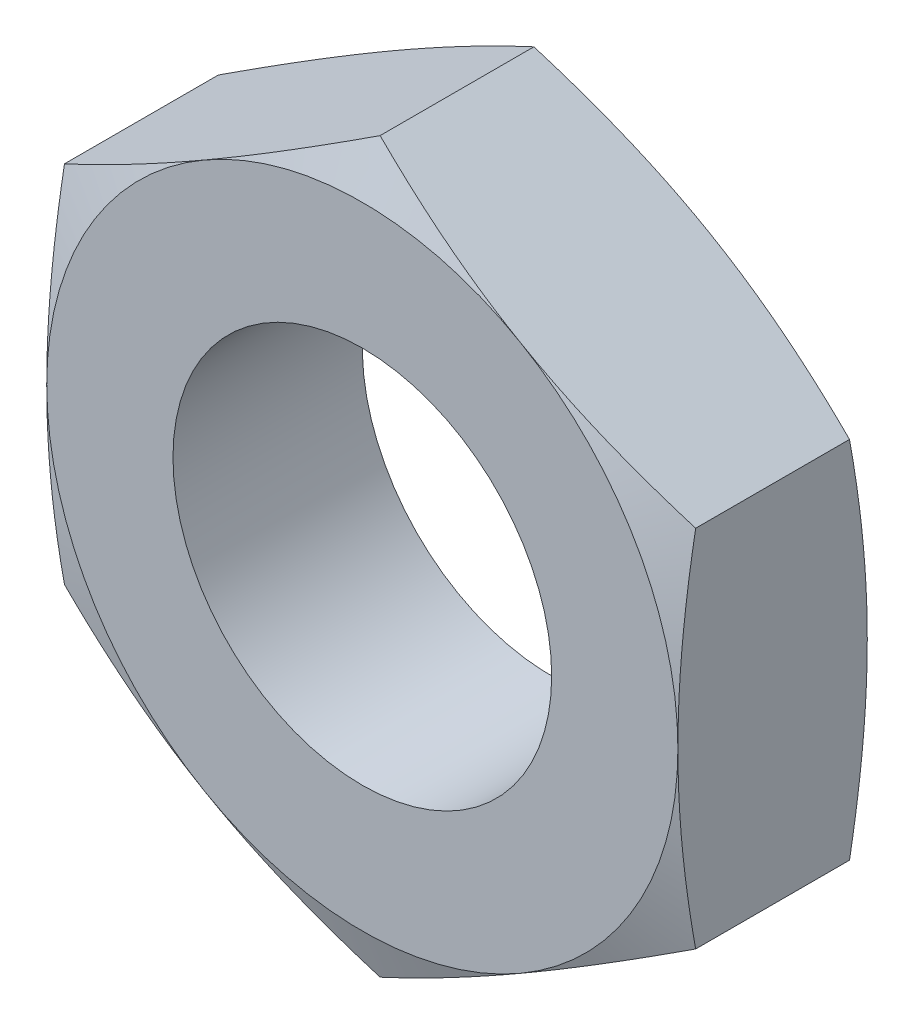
ISO-10303-21;
HEADER;
FILE_DESCRIPTION(('STEP AP214'),'2;1');
FILE_NAME('part.step','',(''),(''),'','','');
FILE_SCHEMA(('AUTOMOTIVE_DESIGN { 1 0 10303 214 1 1 1 1 }'));
ENDSEC;
DATA;
#1=APPLICATION_CONTEXT('core data for automotive mechanical design processes');
#2=APPLICATION_PROTOCOL_DEFINITION('international standard','automotive_design',2000,#1);
#3=PRODUCT_CONTEXT('',#1,'mechanical');
#4=PRODUCT('Part','Part','',(#3));
#5=PRODUCT_RELATED_PRODUCT_CATEGORY('part','',(#4));
#6=PRODUCT_DEFINITION_FORMATION('','',#4);
#7=PRODUCT_DEFINITION_CONTEXT('part definition',#1,'design');
#8=PRODUCT_DEFINITION('design','',#6,#7);
#9=PRODUCT_DEFINITION_SHAPE('','',#8);
#10=(LENGTH_UNIT() NAMED_UNIT(*) SI_UNIT(.MILLI.,.METRE.));
#11=(NAMED_UNIT(*) PLANE_ANGLE_UNIT() SI_UNIT($,.RADIAN.));
#12=(NAMED_UNIT(*) SI_UNIT($,.STERADIAN.) SOLID_ANGLE_UNIT());
#13=UNCERTAINTY_MEASURE_WITH_UNIT(LENGTH_MEASURE(1.E-05),#10,'distance_accuracy_value','');
#14=(GEOMETRIC_REPRESENTATION_CONTEXT(3) GLOBAL_UNCERTAINTY_ASSIGNED_CONTEXT((#13)) GLOBAL_UNIT_ASSIGNED_CONTEXT((#10,
#11,#12)) REPRESENTATION_CONTEXT('',''));
#15=CARTESIAN_POINT('',(0.,0.,0.));
#16=DIRECTION('',(0.,0.,1.));
#17=DIRECTION('',(1.,0.,0.));
#18=AXIS2_PLACEMENT_3D('',#15,#16,#17);
#19=CARTESIAN_POINT('',(5.,5.06000330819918,3.00000000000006));
#20=DIRECTION('',(0.,0.,1.));
#21=DIRECTION('',(-1.,0.,0.));
#22=AXIS2_PLACEMENT_3D('',#19,#20,#21);
#23=PLANE('',#22);
#24=CARTESIAN_POINT('',(0.,0.,3.));
#25=DIRECTION('',(0.,0.,1.));
#26=DIRECTION('',(0.,-1.,0.));
#27=AXIS2_PLACEMENT_3D('',#24,#25,#26);
#28=CIRCLE('',#27,3.);
#29=CARTESIAN_POINT('',(0.,-3.00000000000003,2.99999999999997));
#30=VERTEX_POINT('',#29);
#31=EDGE_CURVE('E109',#30,#30,#28,.T.);
#32=ORIENTED_EDGE('',*,*,#31,.F.);
#33=EDGE_LOOP('',(#32));
#34=FACE_BOUND('',#33,.T.);
#35=CARTESIAN_POINT('',(0.,0.,3.));
#36=DIRECTION('',(0.,0.,-1.));
#37=DIRECTION('',(0.,1.,0.));
#38=AXIS2_PLACEMENT_3D('',#35,#36,#37);
#39=CIRCLE('',#38,5.);
#40=CARTESIAN_POINT('',(-2.5,-4.33012701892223,2.99999999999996));
#41=VERTEX_POINT('',#40);
#42=CARTESIAN_POINT('',(-5.,0.,3.));
#43=VERTEX_POINT('',#42);
#44=EDGE_CURVE('E104',#41,#43,#39,.T.);
#45=ORIENTED_EDGE('',*,*,#44,.F.);
#46=CARTESIAN_POINT('',(0.,0.,3.));
#47=DIRECTION('',(0.,0.,-1.));
#48=DIRECTION('',(0.,1.,0.));
#49=AXIS2_PLACEMENT_3D('',#46,#47,#48);
#50=CIRCLE('',#49,5.);
#51=CARTESIAN_POINT('',(2.5,-4.33012701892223,2.99999999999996));
#52=VERTEX_POINT('',#51);
#53=EDGE_CURVE('E17',#52,#41,#50,.T.);
#54=ORIENTED_EDGE('',*,*,#53,.F.);
#55=CARTESIAN_POINT('',(0.,0.,3.));
#56=DIRECTION('',(0.,0.,-1.));
#57=DIRECTION('',(0.,1.,0.));
#58=AXIS2_PLACEMENT_3D('',#55,#56,#57);
#59=CIRCLE('',#58,5.);
#60=CARTESIAN_POINT('',(5.,0.,3.));
#61=VERTEX_POINT('',#60);
#62=EDGE_CURVE('E101',#61,#52,#59,.T.);
#63=ORIENTED_EDGE('',*,*,#62,.F.);
#64=CARTESIAN_POINT('',(0.,0.,3.));
#65=DIRECTION('',(0.,0.,-1.));
#66=DIRECTION('',(0.,1.,0.));
#67=AXIS2_PLACEMENT_3D('',#64,#65,#66);
#68=CIRCLE('',#67,5.);
#69=CARTESIAN_POINT('',(2.5,4.33012701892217,3.00000000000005));
#70=VERTEX_POINT('',#69);
#71=EDGE_CURVE('E133',#70,#61,#68,.T.);
#72=ORIENTED_EDGE('',*,*,#71,.F.);
#73=CARTESIAN_POINT('',(0.,0.,3.));
#74=DIRECTION('',(0.,0.,-1.));
#75=DIRECTION('',(0.,1.,0.));
#76=AXIS2_PLACEMENT_3D('',#73,#74,#75);
#77=CIRCLE('',#76,5.);
#78=CARTESIAN_POINT('',(-2.5,4.33012701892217,3.00000000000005));
#79=VERTEX_POINT('',#78);
#80=EDGE_CURVE('E119',#79,#70,#77,.T.);
#81=ORIENTED_EDGE('',*,*,#80,.F.);
#82=CARTESIAN_POINT('',(0.,0.,3.));
#83=DIRECTION('',(0.,0.,-1.));
#84=DIRECTION('',(0.,1.,0.));
#85=AXIS2_PLACEMENT_3D('',#82,#83,#84);
#86=CIRCLE('',#85,5.);
#87=EDGE_CURVE('E120',#43,#79,#86,.T.);
#88=ORIENTED_EDGE('',*,*,#87,.F.);
#89=EDGE_LOOP('',(#45,#54,#63,#72,#81,#88));
#90=FACE_BOUND('',#89,.T.);
#91=ADVANCED_FACE('F14',(#34,#90),#23,.T.);
#92=CARTESIAN_POINT('',(0.,0.,3.));
#93=DIRECTION('',(0.,0.,-1.));
#94=DIRECTION('',(0.,1.,0.));
#95=AXIS2_PLACEMENT_3D('',#92,#93,#94);
#96=CONICAL_SURFACE('',#95,5.,1.22173047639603);
#97=ORIENTED_EDGE('',*,*,#53,.T.);
#98=CARTESIAN_POINT('',(0.,-5.77350269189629,2.71846804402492));
#99=CARTESIAN_POINT('',(-0.206342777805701,-5.65437063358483,2.76184718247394));
#100=CARTESIAN_POINT('',(-0.413378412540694,-5.53483855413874,2.80131801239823));
#101=CARTESIAN_POINT('',(-0.828198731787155,-5.29534193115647,2.87070272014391));
#102=CARTESIAN_POINT('',(-1.03598096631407,-5.17537880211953,2.90063628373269));
#103=CARTESIAN_POINT('',(-1.34843659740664,-4.99498245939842,2.93721548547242));
#104=CARTESIAN_POINT('',(-1.4527458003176,-4.93475951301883,2.94802340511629));
#105=CARTESIAN_POINT('',(-1.66156247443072,-4.81419915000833,2.96669455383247));
#106=CARTESIAN_POINT('',(-1.76606994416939,-4.75386173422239,2.97455780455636));
#107=CARTESIAN_POINT('',(-1.97544117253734,-4.63298119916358,2.98721270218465));
#108=CARTESIAN_POINT('',(-2.08030522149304,-4.5724379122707,2.99199798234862));
#109=CARTESIAN_POINT('',(-2.29011229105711,-4.45130574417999,2.99839680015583));
#110=CARTESIAN_POINT('',(-2.39505531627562,-4.39071686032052,3.00001013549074));
#111=CARTESIAN_POINT('',(-2.5,-4.33012701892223,2.99999999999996));
#112=B_SPLINE_CURVE_WITH_KNOTS('',3,(#98,#99,#100,#101,#102,#103,#104,#105,#106,#107,#108,#109,
#110,#111),.UNSPECIFIED.,.F.,.F.,(4,2,2,2,2,2,4),(0.,0.726649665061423,1.45178959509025,
1.81454632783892,2.17730039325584,2.54080241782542,2.90432762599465),.UNSPECIFIED.);
#113=CARTESIAN_POINT('',(0.,-5.77350269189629,2.71846804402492));
#114=VERTEX_POINT('',#113);
#115=EDGE_CURVE('E125',#114,#41,#112,.T.);
#116=ORIENTED_EDGE('',*,*,#115,.F.);
#117=CARTESIAN_POINT('',(2.5,-4.33012701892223,2.99999999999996));
#118=CARTESIAN_POINT('',(2.39505531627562,-4.39071686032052,3.00001013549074));
#119=CARTESIAN_POINT('',(2.29011229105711,-4.45130574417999,2.99839680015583));
#120=CARTESIAN_POINT('',(2.08030522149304,-4.5724379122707,2.99199798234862));
#121=CARTESIAN_POINT('',(1.97544117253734,-4.63298119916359,2.98721270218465));
#122=CARTESIAN_POINT('',(1.76606994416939,-4.75386173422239,2.97455780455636));
#123=CARTESIAN_POINT('',(1.66156247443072,-4.81419915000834,2.96669455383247));
#124=CARTESIAN_POINT('',(1.4527458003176,-4.93475951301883,2.94802340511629));
#125=CARTESIAN_POINT('',(1.34843659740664,-4.99498245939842,2.93721548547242));
#126=CARTESIAN_POINT('',(1.03598096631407,-5.17537880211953,2.90063628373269));
#127=CARTESIAN_POINT('',(0.828198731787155,-5.29534193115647,2.87070272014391));
#128=CARTESIAN_POINT('',(0.413378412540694,-5.53483855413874,2.80131801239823));
#129=CARTESIAN_POINT('',(0.206342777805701,-5.65437063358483,2.76184718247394));
#130=CARTESIAN_POINT('',(0.,-5.77350269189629,2.71846804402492));
#131=B_SPLINE_CURVE_WITH_KNOTS('',3,(#117,#118,#119,#120,#121,#122,#123,#124,#125,#126,#127,
#128,#129,#130),.UNSPECIFIED.,.F.,.F.,(4,2,2,2,2,2,4),(0.,0.363525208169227,0.727027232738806,
1.08978129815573,1.4525380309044,2.17767796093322,2.90432762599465),.UNSPECIFIED.);
#132=EDGE_CURVE('E122',#52,#114,#131,.T.);
#133=ORIENTED_EDGE('',*,*,#132,.F.);
#134=EDGE_LOOP('',(#97,#116,#133));
#135=FACE_BOUND('',#134,.T.);
#136=ADVANCED_FACE('F123',(#135),#96,.T.);
#137=CARTESIAN_POINT('',(0.,0.,3.));
#138=DIRECTION('',(0.,0.,-1.));
#139=DIRECTION('',(0.,1.,0.));
#140=AXIS2_PLACEMENT_3D('',#137,#138,#139);
#141=CONICAL_SURFACE('',#140,5.,1.22173047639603);
#142=ORIENTED_EDGE('',*,*,#44,.T.);
#143=CARTESIAN_POINT('',(-5.,-2.88675134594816,2.71846804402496));
#144=CARTESIAN_POINT('',(-5.,-2.64848722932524,2.76184718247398));
#145=CARTESIAN_POINT('',(-5.,-2.40942307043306,2.80131801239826));
#146=CARTESIAN_POINT('',(-5.,-1.93042982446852,2.87070272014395));
#147=CARTESIAN_POINT('',(-5.,-1.69050356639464,2.90063628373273));
#148=CARTESIAN_POINT('',(-5.,-1.32971088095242,2.93721548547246));
#149=CARTESIAN_POINT('',(-5.,-1.20926498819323,2.94802340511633));
#150=CARTESIAN_POINT('',(-5.,-0.968144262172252,2.96669455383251));
#151=CARTESIAN_POINT('',(-5.,-0.847469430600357,2.9745578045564));
#152=CARTESIAN_POINT('',(-5.,-0.605708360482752,2.98721270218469));
#153=CARTESIAN_POINT('',(-5.,-0.484621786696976,2.99199798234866));
#154=CARTESIAN_POINT('',(-5.,-0.24235745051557,2.99839680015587));
#155=CARTESIAN_POINT('',(-5.,-0.121179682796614,3.00001013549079));
#156=CARTESIAN_POINT('',(-5.,0.,3.));
#157=B_SPLINE_CURVE_WITH_KNOTS('',3,(#143,#144,#145,#146,#147,#148,#149,#150,#151,#152,#153,
#154,#155,#156),.UNSPECIFIED.,.F.,.F.,(4,2,2,2,2,2,4),(0.,0.726649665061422,1.45178959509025,
1.81454632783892,2.17730039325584,2.54080241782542,2.90432762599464),.UNSPECIFIED.);
#158=CARTESIAN_POINT('',(-5.,-2.88675134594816,2.71846804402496));
#159=VERTEX_POINT('',#158);
#160=EDGE_CURVE('E288',#159,#43,#157,.T.);
#161=ORIENTED_EDGE('',*,*,#160,.F.);
#162=CARTESIAN_POINT('',(-2.5,-4.33012701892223,2.99999999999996));
#163=CARTESIAN_POINT('',(-2.60494468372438,-4.26953717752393,3.00001013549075));
#164=CARTESIAN_POINT('',(-2.70988770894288,-4.20894829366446,2.99839680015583));
#165=CARTESIAN_POINT('',(-2.91969477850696,-4.08781612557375,2.99199798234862));
#166=CARTESIAN_POINT('',(-3.02455882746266,-4.02727283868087,2.98721270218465));
#167=CARTESIAN_POINT('',(-3.23393005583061,-3.90639230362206,2.97455780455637));
#168=CARTESIAN_POINT('',(-3.33843752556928,-3.84605488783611,2.96669455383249));
#169=CARTESIAN_POINT('',(-3.5472541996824,-3.72549452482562,2.94802340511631));
#170=CARTESIAN_POINT('',(-3.65156340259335,-3.66527157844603,2.93721548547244));
#171=CARTESIAN_POINT('',(-3.96401903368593,-3.48487523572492,2.90063628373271));
#172=CARTESIAN_POINT('',(-4.17180126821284,-3.36491210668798,2.87070272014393));
#173=CARTESIAN_POINT('',(-4.5866215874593,-3.12541548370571,2.80131801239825));
#174=CARTESIAN_POINT('',(-4.7936572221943,-3.00588340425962,2.76184718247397));
#175=CARTESIAN_POINT('',(-5.,-2.88675134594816,2.71846804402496));
#176=B_SPLINE_CURVE_WITH_KNOTS('',3,(#162,#163,#164,#165,#166,#167,#168,#169,#170,#171,#172,
#173,#174,#175),.UNSPECIFIED.,.F.,.F.,(4,2,2,2,2,2,4),(0.,0.363525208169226,0.727027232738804,
1.08978129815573,1.45253803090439,2.17767796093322,2.90432762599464),.UNSPECIFIED.);
#177=EDGE_CURVE('E269',#41,#159,#176,.T.);
#178=ORIENTED_EDGE('',*,*,#177,.F.);
#179=EDGE_LOOP('',(#142,#161,#178));
#180=FACE_BOUND('',#179,.T.);
#181=ADVANCED_FACE('F282',(#180),#141,.T.);
#182=CARTESIAN_POINT('',(0.,0.,3.));
#183=DIRECTION('',(0.,0.,-1.));
#184=DIRECTION('',(0.,1.,0.));
#185=AXIS2_PLACEMENT_3D('',#182,#183,#184);
#186=CONICAL_SURFACE('',#185,5.,1.22173047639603);
#187=CARTESIAN_POINT('',(-5.,0.,3.));
#188=CARTESIAN_POINT('',(-5.,0.121179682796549,3.00001013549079));
#189=CARTESIAN_POINT('',(-5.,0.242357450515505,2.99839680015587));
#190=CARTESIAN_POINT('',(-5.,0.484621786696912,2.99199798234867));
#191=CARTESIAN_POINT('',(-5.,0.605708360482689,2.9872127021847));
#192=CARTESIAN_POINT('',(-5.,0.847469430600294,2.97455780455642));
#193=CARTESIAN_POINT('',(-5.,0.968144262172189,2.96669455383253));
#194=CARTESIAN_POINT('',(-5.,1.20926498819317,2.94802340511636));
#195=CARTESIAN_POINT('',(-5.,1.32971088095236,2.93721548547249));
#196=CARTESIAN_POINT('',(-5.,1.69050356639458,2.90063628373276));
#197=CARTESIAN_POINT('',(-5.,1.93042982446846,2.87070272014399));
#198=CARTESIAN_POINT('',(-5.,2.409423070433,2.80131801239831));
#199=CARTESIAN_POINT('',(-5.,2.64848722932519,2.76184718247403));
#200=CARTESIAN_POINT('',(-5.,2.8867513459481,2.71846804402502));
#201=B_SPLINE_CURVE_WITH_KNOTS('',3,(#187,#188,#189,#190,#191,#192,#193,#194,#195,#196,#197,
#198,#199,#200),.UNSPECIFIED.,.F.,.F.,(4,2,2,2,2,2,4),(0.,0.363525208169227,0.727027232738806,
1.08978129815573,1.4525380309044,2.17767796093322,2.90432762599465),.UNSPECIFIED.);
#202=CARTESIAN_POINT('',(-5.,2.8867513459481,2.71846804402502));
#203=VERTEX_POINT('',#202);
#204=EDGE_CURVE('E295',#43,#203,#201,.T.);
#205=ORIENTED_EDGE('',*,*,#204,.F.);
#206=ORIENTED_EDGE('',*,*,#87,.T.);
#207=CARTESIAN_POINT('',(-5.,2.8867513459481,2.71846804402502));
#208=CARTESIAN_POINT('',(-4.7936572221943,3.00588340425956,2.76184718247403));
#209=CARTESIAN_POINT('',(-4.58662158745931,3.12541548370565,2.80131801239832));
#210=CARTESIAN_POINT('',(-4.17180126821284,3.36491210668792,2.870702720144));
#211=CARTESIAN_POINT('',(-3.96401903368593,3.48487523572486,2.90063628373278));
#212=CARTESIAN_POINT('',(-3.65156340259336,3.66527157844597,2.93721548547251));
#213=CARTESIAN_POINT('',(-3.5472541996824,3.72549452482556,2.94802340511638));
#214=CARTESIAN_POINT('',(-3.33843752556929,3.84605488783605,2.96669455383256));
#215=CARTESIAN_POINT('',(-3.23393005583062,3.906392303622,2.97455780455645));
#216=CARTESIAN_POINT('',(-3.02455882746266,4.02727283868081,2.98721270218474));
#217=CARTESIAN_POINT('',(-2.91969477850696,4.08781612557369,2.99199798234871));
#218=CARTESIAN_POINT('',(-2.70988770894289,4.2089482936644,2.99839680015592));
#219=CARTESIAN_POINT('',(-2.60494468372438,4.26953717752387,3.00001013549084));
#220=CARTESIAN_POINT('',(-2.5,4.33012701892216,3.00000000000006));
#221=B_SPLINE_CURVE_WITH_KNOTS('',3,(#207,#208,#209,#210,#211,#212,#213,#214,#215,#216,#217,
#218,#219,#220),.UNSPECIFIED.,.F.,.F.,(4,2,2,2,2,2,4),(0.,0.726649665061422,1.45178959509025,
1.81454632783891,2.17730039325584,2.54080241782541,2.90432762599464),.UNSPECIFIED.);
#222=EDGE_CURVE('E303',#203,#79,#221,.T.);
#223=ORIENTED_EDGE('',*,*,#222,.F.);
#224=EDGE_LOOP('',(#205,#206,#223));
#225=FACE_BOUND('',#224,.T.);
#226=ADVANCED_FACE('F156',(#225),#186,.T.);
#227=CARTESIAN_POINT('',(0.,0.,3.));
#228=DIRECTION('',(0.,0.,-1.));
#229=DIRECTION('',(0.,1.,0.));
#230=AXIS2_PLACEMENT_3D('',#227,#228,#229);
#231=CONICAL_SURFACE('',#230,5.,1.22173047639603);
#232=ORIENTED_EDGE('',*,*,#62,.T.);
#233=CARTESIAN_POINT('',(5.,-2.88675134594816,2.71846804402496));
#234=CARTESIAN_POINT('',(4.7936572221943,-3.00588340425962,2.76184718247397));
#235=CARTESIAN_POINT('',(4.5866215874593,-3.12541548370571,2.80131801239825));
#236=CARTESIAN_POINT('',(4.17180126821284,-3.36491210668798,2.87070272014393));
#237=CARTESIAN_POINT('',(3.96401903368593,-3.48487523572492,2.90063628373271));
#238=CARTESIAN_POINT('',(3.65156340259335,-3.66527157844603,2.93721548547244));
#239=CARTESIAN_POINT('',(3.5472541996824,-3.72549452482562,2.94802340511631));
#240=CARTESIAN_POINT('',(3.33843752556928,-3.84605488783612,2.96669455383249));
#241=CARTESIAN_POINT('',(3.23393005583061,-3.90639230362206,2.97455780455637));
#242=CARTESIAN_POINT('',(3.02455882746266,-4.02727283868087,2.98721270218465));
#243=CARTESIAN_POINT('',(2.91969477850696,-4.08781612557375,2.99199798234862));
#244=CARTESIAN_POINT('',(2.70988770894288,-4.20894829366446,2.99839680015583));
#245=CARTESIAN_POINT('',(2.60494468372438,-4.26953717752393,3.00001013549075));
#246=CARTESIAN_POINT('',(2.5,-4.33012701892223,2.99999999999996));
#247=B_SPLINE_CURVE_WITH_KNOTS('',3,(#233,#234,#235,#236,#237,#238,#239,#240,#241,#242,#243,
#244,#245,#246),.UNSPECIFIED.,.F.,.F.,(4,2,2,2,2,2,4),(0.,0.726649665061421,1.45178959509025,
1.81454632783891,2.17730039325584,2.54080241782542,2.90432762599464),.UNSPECIFIED.);
#248=CARTESIAN_POINT('',(5.,-2.88675134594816,2.71846804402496));
#249=VERTEX_POINT('',#248);
#250=EDGE_CURVE('E114',#249,#52,#247,.T.);
#251=ORIENTED_EDGE('',*,*,#250,.F.);
#252=CARTESIAN_POINT('',(5.,0.,3.));
#253=CARTESIAN_POINT('',(5.,-0.121179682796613,3.00001013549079));
#254=CARTESIAN_POINT('',(5.,-0.242357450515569,2.99839680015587));
#255=CARTESIAN_POINT('',(5.,-0.484621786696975,2.99199798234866));
#256=CARTESIAN_POINT('',(5.,-0.605708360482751,2.98721270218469));
#257=CARTESIAN_POINT('',(5.,-0.847469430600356,2.9745578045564));
#258=CARTESIAN_POINT('',(5.,-0.968144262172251,2.96669455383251));
#259=CARTESIAN_POINT('',(5.,-1.20926498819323,2.94802340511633));
#260=CARTESIAN_POINT('',(5.,-1.32971088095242,2.93721548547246));
#261=CARTESIAN_POINT('',(5.,-1.69050356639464,2.90063628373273));
#262=CARTESIAN_POINT('',(5.,-1.93042982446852,2.87070272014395));
#263=CARTESIAN_POINT('',(5.,-2.40942307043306,2.80131801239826));
#264=CARTESIAN_POINT('',(5.,-2.64848722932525,2.76184718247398));
#265=CARTESIAN_POINT('',(5.,-2.88675134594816,2.71846804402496));
#266=B_SPLINE_CURVE_WITH_KNOTS('',3,(#252,#253,#254,#255,#256,#257,#258,#259,#260,#261,#262,
#263,#264,#265),.UNSPECIFIED.,.F.,.F.,(4,2,2,2,2,2,4),(0.,0.363525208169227,0.727027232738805,
1.08978129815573,1.4525380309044,2.17767796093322,2.90432762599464),.UNSPECIFIED.);
#267=EDGE_CURVE('E117',#61,#249,#266,.T.);
#268=ORIENTED_EDGE('',*,*,#267,.F.);
#269=EDGE_LOOP('',(#232,#251,#268));
#270=FACE_BOUND('',#269,.T.);
#271=ADVANCED_FACE('F112',(#270),#231,.T.);
#272=CARTESIAN_POINT('',(0.,0.,3.));
#273=DIRECTION('',(0.,0.,-1.));
#274=DIRECTION('',(0.,1.,0.));
#275=AXIS2_PLACEMENT_3D('',#272,#273,#274);
#276=CONICAL_SURFACE('',#275,5.,1.22173047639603);
#277=CARTESIAN_POINT('',(-2.5,4.33012701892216,3.00000000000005));
#278=CARTESIAN_POINT('',(-2.39505531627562,4.39071686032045,3.00001013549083));
#279=CARTESIAN_POINT('',(-2.29011229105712,4.45130574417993,2.99839680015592));
#280=CARTESIAN_POINT('',(-2.08030522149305,4.57243791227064,2.99199798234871));
#281=CARTESIAN_POINT('',(-1.97544117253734,4.63298119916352,2.98721270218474));
#282=CARTESIAN_POINT('',(-1.76606994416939,4.75386173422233,2.97455780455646));
#283=CARTESIAN_POINT('',(-1.66156247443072,4.81419915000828,2.96669455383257));
#284=CARTESIAN_POINT('',(-1.4527458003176,4.93475951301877,2.94802340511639));
#285=CARTESIAN_POINT('',(-1.34843659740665,4.99498245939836,2.93721548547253));
#286=CARTESIAN_POINT('',(-1.03598096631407,5.17537880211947,2.9006362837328));
#287=CARTESIAN_POINT('',(-0.828198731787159,5.29534193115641,2.87070272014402));
#288=CARTESIAN_POINT('',(-0.413378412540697,5.53483855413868,2.80131801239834));
#289=CARTESIAN_POINT('',(-0.206342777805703,5.65437063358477,2.76184718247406));
#290=CARTESIAN_POINT('',(0.,5.77350269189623,2.71846804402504));
#291=B_SPLINE_CURVE_WITH_KNOTS('',3,(#277,#278,#279,#280,#281,#282,#283,#284,#285,#286,#287,
#288,#289,#290),.UNSPECIFIED.,.F.,.F.,(4,2,2,2,2,2,4),(0.,0.363525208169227,0.727027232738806,
1.08978129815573,1.4525380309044,2.17767796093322,2.90432762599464),.UNSPECIFIED.);
#292=CARTESIAN_POINT('',(0.,5.77350269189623,2.71846804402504));
#293=VERTEX_POINT('',#292);
#294=EDGE_CURVE('E309',#79,#293,#291,.T.);
#295=ORIENTED_EDGE('',*,*,#294,.F.);
#296=ORIENTED_EDGE('',*,*,#80,.T.);
#297=CARTESIAN_POINT('',(0.,5.77350269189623,2.71846804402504));
#298=CARTESIAN_POINT('',(0.206342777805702,5.65437063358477,2.76184718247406));
#299=CARTESIAN_POINT('',(0.413378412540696,5.53483855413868,2.80131801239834));
#300=CARTESIAN_POINT('',(0.828198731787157,5.29534193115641,2.87070272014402));
#301=CARTESIAN_POINT('',(1.03598096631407,5.17537880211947,2.9006362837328));
#302=CARTESIAN_POINT('',(1.34843659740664,4.99498245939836,2.93721548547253));
#303=CARTESIAN_POINT('',(1.4527458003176,4.93475951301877,2.94802340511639));
#304=CARTESIAN_POINT('',(1.66156247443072,4.81419915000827,2.96669455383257));
#305=CARTESIAN_POINT('',(1.76606994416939,4.75386173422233,2.97455780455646));
#306=CARTESIAN_POINT('',(1.97544117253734,4.63298119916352,2.98721270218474));
#307=CARTESIAN_POINT('',(2.08030522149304,4.57243791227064,2.99199798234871));
#308=CARTESIAN_POINT('',(2.29011229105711,4.45130574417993,2.99839680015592));
#309=CARTESIAN_POINT('',(2.39505531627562,4.39071686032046,3.00001013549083));
#310=CARTESIAN_POINT('',(2.5,4.33012701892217,3.00000000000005));
#311=B_SPLINE_CURVE_WITH_KNOTS('',3,(#297,#298,#299,#300,#301,#302,#303,#304,#305,#306,#307,
#308,#309,#310),.UNSPECIFIED.,.F.,.F.,(4,2,2,2,2,2,4),(0.,0.726649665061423,1.45178959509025,
1.81454632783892,2.17730039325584,2.54080241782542,2.90432762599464),.UNSPECIFIED.);
#312=EDGE_CURVE('E170',#293,#70,#311,.T.);
#313=ORIENTED_EDGE('',*,*,#312,.F.);
#314=EDGE_LOOP('',(#295,#296,#313));
#315=FACE_BOUND('',#314,.T.);
#316=ADVANCED_FACE('F155',(#315),#276,.T.);
#317=CARTESIAN_POINT('',(0.,0.,3.));
#318=DIRECTION('',(0.,0.,-1.));
#319=DIRECTION('',(0.,1.,0.));
#320=AXIS2_PLACEMENT_3D('',#317,#318,#319);
#321=CONICAL_SURFACE('',#320,5.,1.22173047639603);
#322=CARTESIAN_POINT('',(2.5,4.33012701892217,3.00000000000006));
#323=CARTESIAN_POINT('',(2.60494468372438,4.26953717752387,3.00001013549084));
#324=CARTESIAN_POINT('',(2.70988770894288,4.2089482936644,2.99839680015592));
#325=CARTESIAN_POINT('',(2.91969477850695,4.08781612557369,2.99199798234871));
#326=CARTESIAN_POINT('',(3.02455882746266,4.0272728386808,2.98721270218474));
#327=CARTESIAN_POINT('',(3.23393005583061,3.906392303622,2.97455780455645));
#328=CARTESIAN_POINT('',(3.33843752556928,3.84605488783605,2.96669455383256));
#329=CARTESIAN_POINT('',(3.5472541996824,3.72549452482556,2.94802340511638));
#330=CARTESIAN_POINT('',(3.65156340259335,3.66527157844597,2.93721548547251));
#331=CARTESIAN_POINT('',(3.96401903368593,3.48487523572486,2.90063628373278));
#332=CARTESIAN_POINT('',(4.17180126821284,3.36491210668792,2.870702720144));
#333=CARTESIAN_POINT('',(4.5866215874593,3.12541548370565,2.80131801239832));
#334=CARTESIAN_POINT('',(4.7936572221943,3.00588340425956,2.76184718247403));
#335=CARTESIAN_POINT('',(5.,2.8867513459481,2.71846804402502));
#336=B_SPLINE_CURVE_WITH_KNOTS('',3,(#322,#323,#324,#325,#326,#327,#328,#329,#330,#331,#332,
#333,#334,#335),.UNSPECIFIED.,.F.,.F.,(4,2,2,2,2,2,4),(0.,0.363525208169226,0.727027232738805,
1.08978129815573,1.45253803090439,2.17767796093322,2.90432762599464),.UNSPECIFIED.);
#337=CARTESIAN_POINT('',(5.,2.8867513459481,2.71846804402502));
#338=VERTEX_POINT('',#337);
#339=EDGE_CURVE('E324',#70,#338,#336,.T.);
#340=ORIENTED_EDGE('',*,*,#339,.F.);
#341=ORIENTED_EDGE('',*,*,#71,.T.);
#342=CARTESIAN_POINT('',(5.,2.8867513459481,2.71846804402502));
#343=CARTESIAN_POINT('',(5.,2.64848722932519,2.76184718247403));
#344=CARTESIAN_POINT('',(5.,2.409423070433,2.80131801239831));
#345=CARTESIAN_POINT('',(5.,1.93042982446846,2.87070272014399));
#346=CARTESIAN_POINT('',(5.,1.69050356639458,2.90063628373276));
#347=CARTESIAN_POINT('',(5.,1.32971088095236,2.93721548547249));
#348=CARTESIAN_POINT('',(5.,1.20926498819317,2.94802340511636));
#349=CARTESIAN_POINT('',(5.,0.96814426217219,2.96669455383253));
#350=CARTESIAN_POINT('',(5.,0.847469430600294,2.97455780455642));
#351=CARTESIAN_POINT('',(5.,0.605708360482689,2.9872127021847));
#352=CARTESIAN_POINT('',(5.,0.484621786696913,2.99199798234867));
#353=CARTESIAN_POINT('',(5.,0.242357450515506,2.99839680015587));
#354=CARTESIAN_POINT('',(5.,0.12117968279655,3.00001013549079));
#355=CARTESIAN_POINT('',(5.,0.,3.));
#356=B_SPLINE_CURVE_WITH_KNOTS('',3,(#342,#343,#344,#345,#346,#347,#348,#349,#350,#351,#352,
#353,#354,#355),.UNSPECIFIED.,.F.,.F.,(4,2,2,2,2,2,4),(0.,0.726649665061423,1.45178959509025,
1.81454632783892,2.17730039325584,2.54080241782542,2.90432762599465),.UNSPECIFIED.);
#357=EDGE_CURVE('E169',#338,#61,#356,.T.);
#358=ORIENTED_EDGE('',*,*,#357,.F.);
#359=EDGE_LOOP('',(#340,#341,#358));
#360=FACE_BOUND('',#359,.T.);
#361=ADVANCED_FACE('F323',(#360),#321,.T.);
#362=CARTESIAN_POINT('',(5.,-2.88675134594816,3.018));
#363=DIRECTION('',(0.5,-0.866025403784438,0.));
#364=DIRECTION('',(-0.866025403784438,-0.5,0.));
#365=AXIS2_PLACEMENT_3D('',#362,#363,#364);
#366=PLANE('',#365);
#367=ORIENTED_EDGE('',*,*,#132,.T.);
#368=DIRECTION('',(0.,0.,-1.));
#369=VECTOR('',#368,1.);
#370=CARTESIAN_POINT('',(0.,-5.77350269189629,2.99999999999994));
#371=LINE('',#370,#369);
#372=CARTESIAN_POINT('',(0.,-5.77350269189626,0.281531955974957));
#373=VERTEX_POINT('',#372);
#374=EDGE_CURVE('E128',#373,#114,#371,.F.);
#375=ORIENTED_EDGE('',*,*,#374,.F.);
#376=CARTESIAN_POINT('',(2.5,-4.3301270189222,0.));
#377=CARTESIAN_POINT('',(2.39505531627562,-4.39071686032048,-1.01354908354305E-05));
#378=CARTESIAN_POINT('',(2.29011229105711,-4.45130574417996,0.0016031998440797));
#379=CARTESIAN_POINT('',(2.08030522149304,-4.57243791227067,0.00800201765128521));
#380=CARTESIAN_POINT('',(1.97544117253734,-4.63298119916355,0.0127872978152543));
#381=CARTESIAN_POINT('',(1.76606994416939,-4.75386173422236,0.0254421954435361));
#382=CARTESIAN_POINT('',(1.66156247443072,-4.8141991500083,0.0333054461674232));
#383=CARTESIAN_POINT('',(1.4527458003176,-4.9347595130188,0.0519765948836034));
#384=CARTESIAN_POINT('',(1.34843659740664,-4.99498245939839,0.0627845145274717));
#385=CARTESIAN_POINT('',(1.03598096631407,-5.1753788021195,0.0993637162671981));
#386=CARTESIAN_POINT('',(0.828198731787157,-5.29534193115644,0.129297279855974));
#387=CARTESIAN_POINT('',(0.413378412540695,-5.53483855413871,0.198681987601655));
#388=CARTESIAN_POINT('',(0.206342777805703,-5.6543706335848,0.238152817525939));
#389=CARTESIAN_POINT('',(0.,-5.77350269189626,0.281531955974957));
#390=B_SPLINE_CURVE_WITH_KNOTS('',3,(#376,#377,#378,#379,#380,#381,#382,#383,#384,#385,#386,
#387,#388,#389),.UNSPECIFIED.,.F.,.F.,(4,2,2,2,2,2,4),(0.,0.363525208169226,0.727027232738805,
1.08978129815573,1.45253803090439,2.17767796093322,2.90432762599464),.UNSPECIFIED.);
#391=CARTESIAN_POINT('',(2.5,-4.3301270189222,0.));
#392=VERTEX_POINT('',#391);
#393=EDGE_CURVE('E240',#392,#373,#390,.T.);
#394=ORIENTED_EDGE('',*,*,#393,.F.);
#395=CARTESIAN_POINT('',(4.99999999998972,-2.88675134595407,0.281531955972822));
#396=CARTESIAN_POINT('',(4.79365722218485,-3.00588340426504,0.238152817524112));
#397=CARTESIAN_POINT('',(4.5866215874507,-3.12541548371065,0.198681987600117));
#398=CARTESIAN_POINT('',(4.17180126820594,-3.36491210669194,0.129297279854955));
#399=CARTESIAN_POINT('',(3.96401903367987,-3.48487523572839,0.0993637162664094));
#400=CARTESIAN_POINT('',(3.65156340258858,-3.66527157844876,0.0627845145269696));
#401=CARTESIAN_POINT('',(3.54725419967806,-3.7254945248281,0.0519765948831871));
#402=CARTESIAN_POINT('',(3.3384375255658,-3.8460548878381,0.0333054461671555));
#403=CARTESIAN_POINT('',(3.23393005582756,-3.90639230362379,0.0254421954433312));
#404=CARTESIAN_POINT('',(3.02455882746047,-4.02727283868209,0.0127872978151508));
#405=CARTESIAN_POINT('',(2.91969477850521,-4.08781612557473,0.00800201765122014));
#406=CARTESIAN_POINT('',(2.70988770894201,-4.20894829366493,0.00160319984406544));
#407=CARTESIAN_POINT('',(2.60494468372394,-4.26953717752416,-1.01354908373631E-05));
#408=CARTESIAN_POINT('',(2.5,-4.3301270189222,0.));
#409=B_SPLINE_CURVE_WITH_KNOTS('',3,(#395,#396,#397,#398,#399,#400,#401,#402,#403,#404,#405,
#406,#407,#408),.UNSPECIFIED.,.F.,.F.,(4,2,2,2,2,2,4),(0.,0.726649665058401,1.45178959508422,
1.81454632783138,2.1773003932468,2.54080241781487,2.90432762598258),.UNSPECIFIED.);
#410=CARTESIAN_POINT('',(4.99999999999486,-2.8867513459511,0.281531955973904));
#411=VERTEX_POINT('',#410);
#412=EDGE_CURVE('E215',#411,#392,#409,.T.);
#413=ORIENTED_EDGE('',*,*,#412,.F.);
#414=DIRECTION('',(0.,0.,-1.));
#415=VECTOR('',#414,1.);
#416=CARTESIAN_POINT('',(5.,-2.88675134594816,3.));
#417=LINE('',#416,#415);
#418=EDGE_CURVE('E132',#249,#411,#417,.T.);
#419=ORIENTED_EDGE('',*,*,#418,.F.);
#420=ORIENTED_EDGE('',*,*,#250,.T.);
#421=EDGE_LOOP('',(#367,#375,#394,#413,#419,#420));
#422=FACE_BOUND('',#421,.T.);
#423=ADVANCED_FACE('F130',(#422),#366,.T.);
#424=CARTESIAN_POINT('',(0.,-5.77350269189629,3.01799999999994));
#425=DIRECTION('',(-0.5,-0.866025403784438,0.));
#426=DIRECTION('',(-0.866025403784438,0.5,0.));
#427=AXIS2_PLACEMENT_3D('',#424,#425,#426);
#428=PLANE('',#427);
#429=DIRECTION('',(0.,0.,-1.));
#430=VECTOR('',#429,1.);
#431=CARTESIAN_POINT('',(-5.,-2.88675134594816,3.));
#432=LINE('',#431,#430);
#433=CARTESIAN_POINT('',(-5.,-2.88675134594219,0.281531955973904));
#434=VERTEX_POINT('',#433);
#435=EDGE_CURVE('E296',#434,#159,#432,.F.);
#436=ORIENTED_EDGE('',*,*,#435,.F.);
#437=CARTESIAN_POINT('',(-2.5,-4.3301270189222,0.));
#438=CARTESIAN_POINT('',(-2.60494468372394,-4.26953717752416,-1.01354908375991E-05));
#439=CARTESIAN_POINT('',(-2.70988770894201,-4.20894829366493,0.00160319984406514));
#440=CARTESIAN_POINT('',(-2.91969477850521,-4.08781612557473,0.00800201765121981));
#441=CARTESIAN_POINT('',(-3.02455882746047,-4.02727283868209,0.0127872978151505));
#442=CARTESIAN_POINT('',(-3.23393005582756,-3.90639230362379,0.0254421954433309));
#443=CARTESIAN_POINT('',(-3.3384375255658,-3.84605488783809,0.033305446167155));
#444=CARTESIAN_POINT('',(-3.54725419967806,-3.7254945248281,0.0519765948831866));
#445=CARTESIAN_POINT('',(-3.65156340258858,-3.66527157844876,0.0627845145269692));
#446=CARTESIAN_POINT('',(-3.96401903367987,-3.48487523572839,0.0993637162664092));
#447=CARTESIAN_POINT('',(-4.17180126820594,-3.36491210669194,0.129297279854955));
#448=CARTESIAN_POINT('',(-4.5866215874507,-3.12541548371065,0.198681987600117));
#449=CARTESIAN_POINT('',(-4.79365722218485,-3.00588340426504,0.238152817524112));
#450=CARTESIAN_POINT('',(-4.99999999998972,-2.88675134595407,0.281531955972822));
#451=B_SPLINE_CURVE_WITH_KNOTS('',3,(#437,#438,#439,#440,#441,#442,#443,#444,#445,#446,#447,
#448,#449,#450),.UNSPECIFIED.,.F.,.F.,(4,2,2,2,2,2,4),(0.,0.363525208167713,0.727027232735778,
1.08978129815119,1.45253803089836,2.17767796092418,2.90432762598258),.UNSPECIFIED.);
#452=CARTESIAN_POINT('',(-2.5,-4.3301270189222,0.));
#453=VERTEX_POINT('',#452);
#454=EDGE_CURVE('E247',#453,#434,#451,.T.);
#455=ORIENTED_EDGE('',*,*,#454,.F.);
#456=CARTESIAN_POINT('',(0.,-5.77350269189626,0.281531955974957));
#457=CARTESIAN_POINT('',(-0.206342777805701,-5.6543706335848,0.238152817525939));
#458=CARTESIAN_POINT('',(-0.413378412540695,-5.53483855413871,0.198681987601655));
#459=CARTESIAN_POINT('',(-0.828198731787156,-5.29534193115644,0.129297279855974));
#460=CARTESIAN_POINT('',(-1.03598096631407,-5.1753788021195,0.0993637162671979));
#461=CARTESIAN_POINT('',(-1.34843659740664,-4.99498245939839,0.0627845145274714));
#462=CARTESIAN_POINT('',(-1.4527458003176,-4.9347595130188,0.0519765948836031));
#463=CARTESIAN_POINT('',(-1.66156247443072,-4.8141991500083,0.0333054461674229));
#464=CARTESIAN_POINT('',(-1.76606994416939,-4.75386173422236,0.0254421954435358));
#465=CARTESIAN_POINT('',(-1.97544117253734,-4.63298119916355,0.012787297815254));
#466=CARTESIAN_POINT('',(-2.08030522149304,-4.57243791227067,0.00800201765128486));
#467=CARTESIAN_POINT('',(-2.29011229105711,-4.45130574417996,0.00160319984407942));
#468=CARTESIAN_POINT('',(-2.39505531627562,-4.39071686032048,-1.01354908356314E-05));
#469=CARTESIAN_POINT('',(-2.5,-4.3301270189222,0.));
#470=B_SPLINE_CURVE_WITH_KNOTS('',3,(#456,#457,#458,#459,#460,#461,#462,#463,#464,#465,#466,
#467,#468,#469),.UNSPECIFIED.,.F.,.F.,(4,2,2,2,2,2,4),(0.,0.726649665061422,1.45178959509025,
1.81454632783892,2.17730039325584,2.54080241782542,2.90432762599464),.UNSPECIFIED.);
#471=EDGE_CURVE('E214',#373,#453,#470,.T.);
#472=ORIENTED_EDGE('',*,*,#471,.F.);
#473=ORIENTED_EDGE('',*,*,#374,.T.);
#474=ORIENTED_EDGE('',*,*,#115,.T.);
#475=ORIENTED_EDGE('',*,*,#177,.T.);
#476=EDGE_LOOP('',(#436,#455,#472,#473,#474,#475));
#477=FACE_BOUND('',#476,.T.);
#478=ADVANCED_FACE('F260',(#477),#428,.T.);
#479=CARTESIAN_POINT('',(-5.,-2.88675134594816,3.018));
#480=DIRECTION('',(-1.,0.,0.));
#481=DIRECTION('',(0.,1.,0.));
#482=AXIS2_PLACEMENT_3D('',#479,#480,#481);
#483=PLANE('',#482);
#484=DIRECTION('',(0.,0.,-1.));
#485=VECTOR('',#484,1.);
#486=CARTESIAN_POINT('',(-5.,2.8867513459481,3.));
#487=LINE('',#486,#485);
#488=CARTESIAN_POINT('',(-4.99999999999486,2.88675134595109,0.281531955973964));
#489=VERTEX_POINT('',#488);
#490=EDGE_CURVE('E302',#489,#203,#487,.F.);
#491=ORIENTED_EDGE('',*,*,#490,.F.);
#492=CARTESIAN_POINT('',(-5.,0.,0.));
#493=CARTESIAN_POINT('',(-5.,0.121179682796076,-1.01354907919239E-05));
#494=CARTESIAN_POINT('',(-5.,0.242357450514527,0.00160319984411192));
#495=CARTESIAN_POINT('',(-5.,0.484621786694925,0.00800201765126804));
#496=CARTESIAN_POINT('',(-5.,0.605708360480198,0.012787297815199));
#497=CARTESIAN_POINT('',(-5.,0.8474694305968,0.0254421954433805));
#498=CARTESIAN_POINT('',(-5.,0.968144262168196,0.0333054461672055));
#499=CARTESIAN_POINT('',(-5.,1.20926498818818,0.0519765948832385));
#500=CARTESIAN_POINT('',(-5.,1.32971088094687,0.0627845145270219));
#501=CARTESIAN_POINT('',(-5.,1.69050356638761,0.0993637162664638));
#502=CARTESIAN_POINT('',(-5.,1.9304298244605,0.12929727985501));
#503=CARTESIAN_POINT('',(-5.,2.40942307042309,0.198681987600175));
#504=CARTESIAN_POINT('',(-5.,2.6484872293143,0.23815281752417));
#505=CARTESIAN_POINT('',(-5.,2.88675134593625,0.281531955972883));
#506=B_SPLINE_CURVE_WITH_KNOTS('',3,(#492,#493,#494,#495,#496,#497,#498,#499,#500,#501,#502,
#503,#504,#505),.UNSPECIFIED.,.F.,.F.,(4,2,2,2,2,2,4),(0.,0.363525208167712,0.727027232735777,
1.08978129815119,1.45253803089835,2.17767796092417,2.90432762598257),.UNSPECIFIED.);
#507=CARTESIAN_POINT('',(-5.,0.,0.));
#508=VERTEX_POINT('',#507);
#509=EDGE_CURVE('E399',#508,#489,#506,.T.);
#510=ORIENTED_EDGE('',*,*,#509,.F.);
#511=CARTESIAN_POINT('',(-5.,-2.88675134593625,0.281531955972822));
#512=CARTESIAN_POINT('',(-5.,-2.64848722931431,0.238152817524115));
#513=CARTESIAN_POINT('',(-5.,-2.40942307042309,0.198681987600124));
#514=CARTESIAN_POINT('',(-5.,-1.93042982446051,0.12929727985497));
#515=CARTESIAN_POINT('',(-5.,-1.69050356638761,0.0993637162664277));
#516=CARTESIAN_POINT('',(-5.,-1.32971088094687,0.0627845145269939));
#517=CARTESIAN_POINT('',(-5.,-1.20926498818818,0.0519765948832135));
#518=CARTESIAN_POINT('',(-5.,-0.968144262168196,0.0333054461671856));
#519=CARTESIAN_POINT('',(-5.,-0.8474694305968,0.0254421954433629));
#520=CARTESIAN_POINT('',(-5.,-0.605708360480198,0.0127872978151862));
#521=CARTESIAN_POINT('',(-5.,-0.484621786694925,0.00800201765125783));
#522=CARTESIAN_POINT('',(-5.,-0.242357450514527,0.00160319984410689));
#523=CARTESIAN_POINT('',(-5.,-0.121179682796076,-1.01354907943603E-05));
#524=CARTESIAN_POINT('',(-5.,0.,0.));
#525=B_SPLINE_CURVE_WITH_KNOTS('',3,(#511,#512,#513,#514,#515,#516,#517,#518,#519,#520,#521,
#522,#523,#524),.UNSPECIFIED.,.F.,.F.,(4,2,2,2,2,2,4),(0.,0.7266496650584,1.45178959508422,
1.81454632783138,2.1773003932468,2.54080241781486,2.90432762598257),.UNSPECIFIED.);
#526=EDGE_CURVE('E254',#434,#508,#525,.T.);
#527=ORIENTED_EDGE('',*,*,#526,.F.);
#528=ORIENTED_EDGE('',*,*,#435,.T.);
#529=ORIENTED_EDGE('',*,*,#160,.T.);
#530=ORIENTED_EDGE('',*,*,#204,.T.);
#531=EDGE_LOOP('',(#491,#510,#527,#528,#529,#530));
#532=FACE_BOUND('',#531,.T.);
#533=ADVANCED_FACE('F263',(#532),#483,.T.);
#534=CARTESIAN_POINT('',(-5.,2.8867513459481,3.018));
#535=DIRECTION('',(-0.5,0.866025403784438,0.));
#536=DIRECTION('',(0.866025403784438,0.5,0.));
#537=AXIS2_PLACEMENT_3D('',#534,#535,#536);
#538=PLANE('',#537);
#539=DIRECTION('',(0.,0.,-1.));
#540=VECTOR('',#539,1.);
#541=CARTESIAN_POINT('',(0.,5.77350269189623,3.00000000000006));
#542=LINE('',#541,#540);
#543=CARTESIAN_POINT('',(4.94320949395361E-12,5.7735026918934,0.281531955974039));
#544=VERTEX_POINT('',#543);
#545=EDGE_CURVE('E345',#544,#293,#542,.F.);
#546=ORIENTED_EDGE('',*,*,#545,.F.);
#547=CARTESIAN_POINT('',(-2.5,4.3301270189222,0.));
#548=CARTESIAN_POINT('',(-2.39505531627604,4.39071686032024,-1.01354907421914E-05));
#549=CARTESIAN_POINT('',(-2.29011229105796,4.45130574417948,0.00160319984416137));
#550=CARTESIAN_POINT('',(-2.08030522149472,4.5724379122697,0.00800201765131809));
#551=CARTESIAN_POINT('',(-1.97544117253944,4.63298119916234,0.01278729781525));
#552=CARTESIAN_POINT('',(-1.76606994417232,4.75386173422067,0.0254421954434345));
#553=CARTESIAN_POINT('',(-1.66156247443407,4.81419915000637,0.0333054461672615));
#554=CARTESIAN_POINT('',(-1.45274580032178,4.93475951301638,0.0519765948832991));
#555=CARTESIAN_POINT('',(-1.34843659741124,4.99498245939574,0.0627845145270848));
#556=CARTESIAN_POINT('',(-1.0359809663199,5.17537880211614,0.0993637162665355));
#557=CARTESIAN_POINT('',(-0.828198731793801,5.2953419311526,0.12929727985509));
#558=CARTESIAN_POINT('',(-0.413378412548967,5.53483855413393,0.198681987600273));
#559=CARTESIAN_POINT('',(-0.206342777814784,5.65437063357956,0.238152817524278));
#560=CARTESIAN_POINT('',(-9.88702044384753E-12,5.77350269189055,0.281531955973));
#561=B_SPLINE_CURVE_WITH_KNOTS('',3,(#547,#548,#549,#550,#551,#552,#553,#554,#555,#556,#557,
#558,#559,#560),.UNSPECIFIED.,.F.,.F.,(4,2,2,2,2,2,4),(0.,0.363525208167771,0.727027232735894,
1.08978129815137,1.45253803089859,2.17767796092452,2.90432762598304),.UNSPECIFIED.);
#562=CARTESIAN_POINT('',(-2.5,4.3301270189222,0.));
#563=VERTEX_POINT('',#562);
#564=EDGE_CURVE('E386',#563,#544,#561,.T.);
#565=ORIENTED_EDGE('',*,*,#564,.F.);
#566=CARTESIAN_POINT('',(-4.99999999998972,2.88675134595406,0.281531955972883));
#567=CARTESIAN_POINT('',(-4.79365722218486,3.00588340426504,0.238152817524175));
#568=CARTESIAN_POINT('',(-4.58662158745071,3.12541548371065,0.198681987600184));
#569=CARTESIAN_POINT('',(-4.17180126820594,3.36491210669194,0.129297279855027));
#570=CARTESIAN_POINT('',(-3.96401903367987,3.48487523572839,0.0993637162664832));
#571=CARTESIAN_POINT('',(-3.65156340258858,3.66527157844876,0.0627845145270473));
#572=CARTESIAN_POINT('',(-3.54725419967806,3.7254945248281,0.0519765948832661));
#573=CARTESIAN_POINT('',(-3.3384375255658,3.8460548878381,0.0333054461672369));
#574=CARTESIAN_POINT('',(-3.23393005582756,3.9063923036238,0.0254421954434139));
#575=CARTESIAN_POINT('',(-3.02455882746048,4.0272728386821,0.012787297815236));
#576=CARTESIAN_POINT('',(-2.91969477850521,4.08781612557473,0.00800201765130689));
#577=CARTESIAN_POINT('',(-2.70988770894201,4.20894829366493,0.00160319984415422));
#578=CARTESIAN_POINT('',(-2.60494468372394,4.26953717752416,-1.01354907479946E-05));
#579=CARTESIAN_POINT('',(-2.5,4.3301270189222,0.));
#580=B_SPLINE_CURVE_WITH_KNOTS('',3,(#566,#567,#568,#569,#570,#571,#572,#573,#574,#575,#576,
#577,#578,#579),.UNSPECIFIED.,.F.,.F.,(4,2,2,2,2,2,4),(0.,0.726649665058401,1.45178959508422,
1.81454632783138,2.1773003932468,2.54080241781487,2.90432762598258),.UNSPECIFIED.);
#581=EDGE_CURVE('E393',#489,#563,#580,.T.);
#582=ORIENTED_EDGE('',*,*,#581,.F.);
#583=ORIENTED_EDGE('',*,*,#490,.T.);
#584=ORIENTED_EDGE('',*,*,#222,.T.);
#585=ORIENTED_EDGE('',*,*,#294,.T.);
#586=EDGE_LOOP('',(#546,#565,#582,#583,#584,#585));
#587=FACE_BOUND('',#586,.T.);
#588=ADVANCED_FACE('F187',(#587),#538,.T.);
#589=CARTESIAN_POINT('',(5.,2.8867513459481,3.018));
#590=DIRECTION('',(1.,0.,0.));
#591=DIRECTION('',(0.,-1.,0.));
#592=AXIS2_PLACEMENT_3D('',#589,#590,#591);
#593=PLANE('',#592);
#594=ORIENTED_EDGE('',*,*,#267,.T.);
#595=ORIENTED_EDGE('',*,*,#418,.T.);
#596=CARTESIAN_POINT('',(5.,0.,0.));
#597=CARTESIAN_POINT('',(5.,-0.121179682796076,-1.01354907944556E-05));
#598=CARTESIAN_POINT('',(5.,-0.242357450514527,0.00160319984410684));
#599=CARTESIAN_POINT('',(5.,-0.484621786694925,0.00800201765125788));
#600=CARTESIAN_POINT('',(5.,-0.605708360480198,0.0127872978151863));
#601=CARTESIAN_POINT('',(5.,-0.8474694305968,0.0254421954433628));
#602=CARTESIAN_POINT('',(5.,-0.968144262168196,0.0333054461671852));
#603=CARTESIAN_POINT('',(5.,-1.20926498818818,0.0519765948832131));
#604=CARTESIAN_POINT('',(5.,-1.32971088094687,0.0627845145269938));
#605=CARTESIAN_POINT('',(5.,-1.69050356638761,0.0993637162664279));
#606=CARTESIAN_POINT('',(5.,-1.93042982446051,0.12929727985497));
#607=CARTESIAN_POINT('',(5.,-2.40942307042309,0.198681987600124));
#608=CARTESIAN_POINT('',(5.,-2.64848722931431,0.238152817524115));
#609=CARTESIAN_POINT('',(5.,-2.88675134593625,0.281531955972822));
#610=B_SPLINE_CURVE_WITH_KNOTS('',3,(#596,#597,#598,#599,#600,#601,#602,#603,#604,#605,#606,
#607,#608,#609),.UNSPECIFIED.,.F.,.F.,(4,2,2,2,2,2,4),(0.,0.363525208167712,0.727027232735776,
1.08978129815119,1.45253803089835,2.17767796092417,2.90432762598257),.UNSPECIFIED.);
#611=CARTESIAN_POINT('',(5.,0.,0.));
#612=VERTEX_POINT('',#611);
#613=EDGE_CURVE('E206',#612,#411,#610,.T.);
#614=ORIENTED_EDGE('',*,*,#613,.F.);
#615=CARTESIAN_POINT('',(5.,2.88675134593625,0.281531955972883));
#616=CARTESIAN_POINT('',(5.,2.6484872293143,0.238152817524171));
#617=CARTESIAN_POINT('',(5.,2.40942307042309,0.198681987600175));
#618=CARTESIAN_POINT('',(5.,1.9304298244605,0.129297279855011));
#619=CARTESIAN_POINT('',(5.,1.69050356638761,0.0993637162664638));
#620=CARTESIAN_POINT('',(5.,1.32971088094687,0.0627845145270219));
#621=CARTESIAN_POINT('',(5.,1.20926498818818,0.0519765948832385));
#622=CARTESIAN_POINT('',(5.,0.968144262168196,0.0333054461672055));
#623=CARTESIAN_POINT('',(5.,0.8474694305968,0.0254421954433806));
#624=CARTESIAN_POINT('',(5.,0.605708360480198,0.012787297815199));
#625=CARTESIAN_POINT('',(5.,0.484621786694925,0.00800201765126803));
#626=CARTESIAN_POINT('',(5.,0.242357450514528,0.00160319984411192));
#627=CARTESIAN_POINT('',(5.,0.121179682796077,-1.01354907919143E-05));
#628=CARTESIAN_POINT('',(5.,0.,0.));
#629=B_SPLINE_CURVE_WITH_KNOTS('',3,(#615,#616,#617,#618,#619,#620,#621,#622,#623,#624,#625,
#626,#627,#628),.UNSPECIFIED.,.F.,.F.,(4,2,2,2,2,2,4),(0.,0.7266496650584,1.45178959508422,
1.81454632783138,2.1773003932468,2.54080241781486,2.90432762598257),.UNSPECIFIED.);
#630=CARTESIAN_POINT('',(5.,2.88675134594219,0.281531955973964));
#631=VERTEX_POINT('',#630);
#632=EDGE_CURVE('E197',#631,#612,#629,.T.);
#633=ORIENTED_EDGE('',*,*,#632,.F.);
#634=DIRECTION('',(0.,0.,-1.));
#635=VECTOR('',#634,1.);
#636=CARTESIAN_POINT('',(5.,2.8867513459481,3.));
#637=LINE('',#636,#635);
#638=EDGE_CURVE('E319',#338,#631,#637,.T.);
#639=ORIENTED_EDGE('',*,*,#638,.F.);
#640=ORIENTED_EDGE('',*,*,#357,.T.);
#641=EDGE_LOOP('',(#594,#595,#614,#633,#639,#640));
#642=FACE_BOUND('',#641,.T.);
#643=ADVANCED_FACE('F182',(#642),#593,.T.);
#644=CARTESIAN_POINT('',(0.,5.77350269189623,3.01800000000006));
#645=DIRECTION('',(0.5,0.866025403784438,0.));
#646=DIRECTION('',(0.866025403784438,-0.5,0.));
#647=AXIS2_PLACEMENT_3D('',#644,#645,#646);
#648=PLANE('',#647);
#649=ORIENTED_EDGE('',*,*,#339,.T.);
#650=ORIENTED_EDGE('',*,*,#638,.T.);
#651=CARTESIAN_POINT('',(2.5,4.3301270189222,0.));
#652=CARTESIAN_POINT('',(2.60494468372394,4.26953717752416,-1.01354907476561E-05));
#653=CARTESIAN_POINT('',(2.70988770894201,4.20894829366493,0.00160319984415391));
#654=CARTESIAN_POINT('',(2.91969477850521,4.08781612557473,0.00800201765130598));
#655=CARTESIAN_POINT('',(3.02455882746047,4.0272728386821,0.0127872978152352));
#656=CARTESIAN_POINT('',(3.23393005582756,3.9063923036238,0.0254421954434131));
#657=CARTESIAN_POINT('',(3.3384375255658,3.8460548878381,0.0333054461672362));
#658=CARTESIAN_POINT('',(3.54725419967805,3.7254945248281,0.0519765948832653));
#659=CARTESIAN_POINT('',(3.65156340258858,3.66527157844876,0.0627845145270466));
#660=CARTESIAN_POINT('',(3.96401903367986,3.48487523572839,0.0993637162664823));
#661=CARTESIAN_POINT('',(4.17180126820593,3.36491210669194,0.129297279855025));
#662=CARTESIAN_POINT('',(4.5866215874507,3.12541548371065,0.198681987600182));
#663=CARTESIAN_POINT('',(4.79365722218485,3.00588340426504,0.238152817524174));
#664=CARTESIAN_POINT('',(4.99999999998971,2.88675134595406,0.281531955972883));
#665=B_SPLINE_CURVE_WITH_KNOTS('',3,(#651,#652,#653,#654,#655,#656,#657,#658,#659,#660,#661,
#662,#663,#664),.UNSPECIFIED.,.F.,.F.,(4,2,2,2,2,2,4),(0.,0.363525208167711,0.727027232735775,
1.08978129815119,1.45253803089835,2.17767796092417,2.90432762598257),.UNSPECIFIED.);
#666=CARTESIAN_POINT('',(2.5,4.3301270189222,0.));
#667=VERTEX_POINT('',#666);
#668=EDGE_CURVE('E32',#667,#631,#665,.T.);
#669=ORIENTED_EDGE('',*,*,#668,.F.);
#670=CARTESIAN_POINT('',(9.88655435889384E-12,5.77350269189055,0.281531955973));
#671=CARTESIAN_POINT('',(0.206342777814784,5.65437063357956,0.238152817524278));
#672=CARTESIAN_POINT('',(0.413378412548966,5.53483855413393,0.198681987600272));
#673=CARTESIAN_POINT('',(0.828198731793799,5.2953419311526,0.12929727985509));
#674=CARTESIAN_POINT('',(1.0359809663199,5.17537880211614,0.0993637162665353));
#675=CARTESIAN_POINT('',(1.34843659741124,4.99498245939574,0.0627845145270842));
#676=CARTESIAN_POINT('',(1.45274580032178,4.93475951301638,0.0519765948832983));
#677=CARTESIAN_POINT('',(1.66156247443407,4.81419915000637,0.0333054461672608));
#678=CARTESIAN_POINT('',(1.76606994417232,4.75386173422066,0.025442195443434));
#679=CARTESIAN_POINT('',(1.97544117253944,4.63298119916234,0.0127872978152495));
#680=CARTESIAN_POINT('',(2.08030522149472,4.5724379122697,0.00800201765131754));
#681=CARTESIAN_POINT('',(2.29011229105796,4.45130574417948,0.00160319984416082));
#682=CARTESIAN_POINT('',(2.39505531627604,4.39071686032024,-1.01354907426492E-05));
#683=CARTESIAN_POINT('',(2.5,4.3301270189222,0.));
#684=B_SPLINE_CURVE_WITH_KNOTS('',3,(#670,#671,#672,#673,#674,#675,#676,#677,#678,#679,#680,
#681,#682,#683),.UNSPECIFIED.,.F.,.F.,(4,2,2,2,2,2,4),(0.,0.726649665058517,1.45178959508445,
1.81454632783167,2.17730039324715,2.54080241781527,2.90432762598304),.UNSPECIFIED.);
#685=EDGE_CURVE('E380',#544,#667,#684,.T.);
#686=ORIENTED_EDGE('',*,*,#685,.F.);
#687=ORIENTED_EDGE('',*,*,#545,.T.);
#688=ORIENTED_EDGE('',*,*,#312,.T.);
#689=EDGE_LOOP('',(#649,#650,#669,#686,#687,#688));
#690=FACE_BOUND('',#689,.T.);
#691=ADVANCED_FACE('F186',(#690),#648,.T.);
#692=CARTESIAN_POINT('',(0.,0.,0.));
#693=DIRECTION('',(0.,0.,1.));
#694=DIRECTION('',(0.,-1.,0.));
#695=AXIS2_PLACEMENT_3D('',#692,#693,#694);
#696=CONICAL_SURFACE('',#695,5.,1.22173047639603);
#697=CARTESIAN_POINT('',(0.,0.,0.));
#698=DIRECTION('',(0.,0.,1.));
#699=DIRECTION('',(0.,-1.,0.));
#700=AXIS2_PLACEMENT_3D('',#697,#698,#699);
#701=CIRCLE('',#700,5.);
#702=EDGE_CURVE('E358',#612,#392,#701,.F.);
#703=ORIENTED_EDGE('',*,*,#702,.F.);
#704=ORIENTED_EDGE('',*,*,#613,.T.);
#705=ORIENTED_EDGE('',*,*,#412,.T.);
#706=EDGE_LOOP('',(#703,#704,#705));
#707=FACE_BOUND('',#706,.T.);
#708=ADVANCED_FACE('F226',(#707),#696,.T.);
#709=CARTESIAN_POINT('',(0.,0.,0.));
#710=DIRECTION('',(0.,0.,1.));
#711=DIRECTION('',(0.,-1.,0.));
#712=AXIS2_PLACEMENT_3D('',#709,#710,#711);
#713=CONICAL_SURFACE('',#712,5.,1.22173047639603);
#714=CARTESIAN_POINT('',(0.,0.,0.));
#715=DIRECTION('',(0.,0.,1.));
#716=DIRECTION('',(0.,-1.,0.));
#717=AXIS2_PLACEMENT_3D('',#714,#715,#716);
#718=CIRCLE('',#717,5.);
#719=EDGE_CURVE('E355',#392,#453,#718,.F.);
#720=ORIENTED_EDGE('',*,*,#719,.F.);
#721=ORIENTED_EDGE('',*,*,#393,.T.);
#722=ORIENTED_EDGE('',*,*,#471,.T.);
#723=EDGE_LOOP('',(#720,#721,#722));
#724=FACE_BOUND('',#723,.T.);
#725=ADVANCED_FACE('F229',(#724),#713,.T.);
#726=CARTESIAN_POINT('',(0.,0.,0.));
#727=DIRECTION('',(0.,0.,1.));
#728=DIRECTION('',(0.,-1.,0.));
#729=AXIS2_PLACEMENT_3D('',#726,#727,#728);
#730=CONICAL_SURFACE('',#729,5.,1.22173047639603);
#731=ORIENTED_EDGE('',*,*,#526,.T.);
#732=CARTESIAN_POINT('',(0.,0.,0.));
#733=DIRECTION('',(0.,0.,1.));
#734=DIRECTION('',(0.,-1.,0.));
#735=AXIS2_PLACEMENT_3D('',#732,#733,#734);
#736=CIRCLE('',#735,5.);
#737=EDGE_CURVE('E352',#453,#508,#736,.F.);
#738=ORIENTED_EDGE('',*,*,#737,.F.);
#739=ORIENTED_EDGE('',*,*,#454,.T.);
#740=EDGE_LOOP('',(#731,#738,#739));
#741=FACE_BOUND('',#740,.T.);
#742=ADVANCED_FACE('F235',(#741),#730,.T.);
#743=CARTESIAN_POINT('',(0.,0.,0.));
#744=DIRECTION('',(0.,0.,1.));
#745=DIRECTION('',(0.,-1.,0.));
#746=AXIS2_PLACEMENT_3D('',#743,#744,#745);
#747=CONICAL_SURFACE('',#746,5.,1.22173047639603);
#748=ORIENTED_EDGE('',*,*,#581,.T.);
#749=CARTESIAN_POINT('',(0.,0.,0.));
#750=DIRECTION('',(0.,0.,1.));
#751=DIRECTION('',(0.,-1.,0.));
#752=AXIS2_PLACEMENT_3D('',#749,#750,#751);
#753=CIRCLE('',#752,5.);
#754=EDGE_CURVE('E349',#508,#563,#753,.F.);
#755=ORIENTED_EDGE('',*,*,#754,.F.);
#756=ORIENTED_EDGE('',*,*,#509,.T.);
#757=EDGE_LOOP('',(#748,#755,#756));
#758=FACE_BOUND('',#757,.T.);
#759=ADVANCED_FACE('F376',(#758),#747,.T.);
#760=CARTESIAN_POINT('',(0.,0.,0.));
#761=DIRECTION('',(0.,0.,1.));
#762=DIRECTION('',(0.,-1.,0.));
#763=AXIS2_PLACEMENT_3D('',#760,#761,#762);
#764=CONICAL_SURFACE('',#763,5.,1.22173047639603);
#765=ORIENTED_EDGE('',*,*,#685,.T.);
#766=CARTESIAN_POINT('',(0.,0.,0.));
#767=DIRECTION('',(0.,0.,1.));
#768=DIRECTION('',(0.,-1.,0.));
#769=AXIS2_PLACEMENT_3D('',#766,#767,#768);
#770=CIRCLE('',#769,5.);
#771=EDGE_CURVE('E23',#563,#667,#770,.F.);
#772=ORIENTED_EDGE('',*,*,#771,.F.);
#773=ORIENTED_EDGE('',*,*,#564,.T.);
#774=EDGE_LOOP('',(#765,#772,#773));
#775=FACE_BOUND('',#774,.T.);
#776=ADVANCED_FACE('F370',(#775),#764,.T.);
#777=CARTESIAN_POINT('',(0.,0.,0.));
#778=DIRECTION('',(0.,0.,1.));
#779=DIRECTION('',(0.,-1.,0.));
#780=AXIS2_PLACEMENT_3D('',#777,#778,#779);
#781=CONICAL_SURFACE('',#780,5.,1.22173047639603);
#782=CARTESIAN_POINT('',(0.,0.,0.));
#783=DIRECTION('',(0.,0.,1.));
#784=DIRECTION('',(0.,-1.,0.));
#785=AXIS2_PLACEMENT_3D('',#782,#783,#784);
#786=CIRCLE('',#785,5.);
#787=EDGE_CURVE('E9',#667,#612,#786,.F.);
#788=ORIENTED_EDGE('',*,*,#787,.F.);
#789=ORIENTED_EDGE('',*,*,#668,.T.);
#790=ORIENTED_EDGE('',*,*,#632,.T.);
#791=EDGE_LOOP('',(#788,#789,#790));
#792=FACE_BOUND('',#791,.T.);
#793=ADVANCED_FACE('F364',(#792),#781,.T.);
#794=CARTESIAN_POINT('',(-5.,5.06000330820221,0.));
#795=DIRECTION('',(0.,0.,-1.));
#796=DIRECTION('',(1.,0.,0.));
#797=AXIS2_PLACEMENT_3D('',#794,#795,#796);
#798=PLANE('',#797);
#799=CARTESIAN_POINT('',(0.,0.,0.));
#800=DIRECTION('',(0.,0.,-1.));
#801=DIRECTION('',(0.,1.,0.));
#802=AXIS2_PLACEMENT_3D('',#799,#800,#801);
#803=CIRCLE('',#802,3.);
#804=CARTESIAN_POINT('',(0.,3.,0.));
#805=VERTEX_POINT('',#804);
#806=EDGE_CURVE('E436',#805,#805,#803,.T.);
#807=ORIENTED_EDGE('',*,*,#806,.F.);
#808=EDGE_LOOP('',(#807));
#809=FACE_BOUND('',#808,.T.);
#810=ORIENTED_EDGE('',*,*,#771,.T.);
#811=ORIENTED_EDGE('',*,*,#787,.T.);
#812=ORIENTED_EDGE('',*,*,#702,.T.);
#813=ORIENTED_EDGE('',*,*,#719,.T.);
#814=ORIENTED_EDGE('',*,*,#737,.T.);
#815=ORIENTED_EDGE('',*,*,#754,.T.);
#816=EDGE_LOOP('',(#810,#811,#812,#813,#814,#815));
#817=FACE_BOUND('',#816,.T.);
#818=ADVANCED_FACE('F369',(#809,#817),#798,.T.);
#819=CARTESIAN_POINT('',(0.,-1.1521895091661E-13,11.));
#820=DIRECTION('',(0.,0.,-1.));
#821=DIRECTION('',(0.,1.,0.));
#822=AXIS2_PLACEMENT_3D('',#819,#820,#821);
#823=CYLINDRICAL_SURFACE('',#822,3.);
#824=ORIENTED_EDGE('',*,*,#31,.T.);
#825=EDGE_LOOP('',(#824));
#826=FACE_BOUND('',#825,.T.);
#827=ORIENTED_EDGE('',*,*,#806,.T.);
#828=EDGE_LOOP('',(#827));
#829=FACE_BOUND('',#828,.T.);
#830=ADVANCED_FACE('F427',(#826,#829),#823,.F.);
#831=CLOSED_SHELL('',(#91,#136,#181,#226,#271,#316,#361,#423,#478,#533,#588,#643,#691,#708,#725,
#742,#759,#776,#793,#818,#830));
#832=MANIFOLD_SOLID_BREP('B1',#831);
#833=ADVANCED_BREP_SHAPE_REPRESENTATION('',(#18,#832),#14);
#834=SHAPE_DEFINITION_REPRESENTATION(#9,#833);
ENDSEC;
END-ISO-10303-21;
